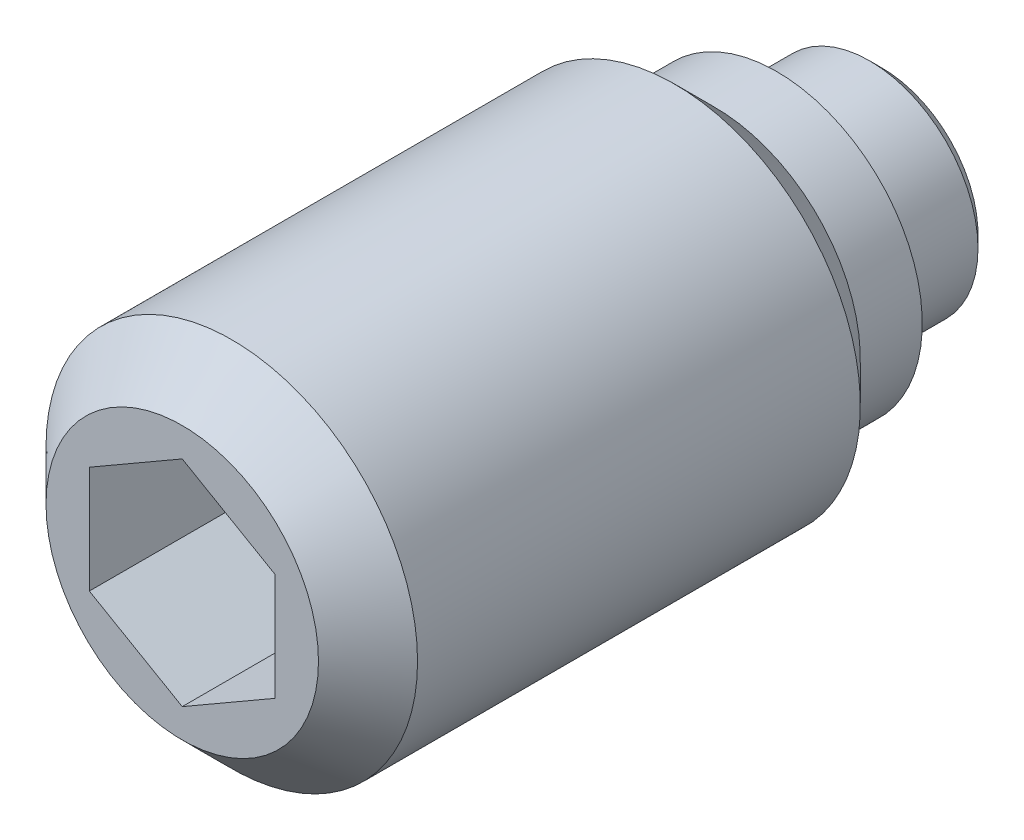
ISO-10303-21;
HEADER;
FILE_DESCRIPTION(('STEP AP214'),'2;1');
FILE_NAME('part.step','',(''),(''),'','','');
FILE_SCHEMA(('AUTOMOTIVE_DESIGN { 1 0 10303 214 1 1 1 1 }'));
ENDSEC;
DATA;
#1=APPLICATION_CONTEXT('core data for automotive mechanical design processes');
#2=APPLICATION_PROTOCOL_DEFINITION('international standard','automotive_design',2000,#1);
#3=PRODUCT_CONTEXT('',#1,'mechanical');
#4=PRODUCT('Part','Part','',(#3));
#5=PRODUCT_RELATED_PRODUCT_CATEGORY('part','',(#4));
#6=PRODUCT_DEFINITION_FORMATION('','',#4);
#7=PRODUCT_DEFINITION_CONTEXT('part definition',#1,'design');
#8=PRODUCT_DEFINITION('design','',#6,#7);
#9=PRODUCT_DEFINITION_SHAPE('','',#8);
#10=(LENGTH_UNIT() NAMED_UNIT(*) SI_UNIT(.MILLI.,.METRE.));
#11=(NAMED_UNIT(*) PLANE_ANGLE_UNIT() SI_UNIT($,.RADIAN.));
#12=(NAMED_UNIT(*) SI_UNIT($,.STERADIAN.) SOLID_ANGLE_UNIT());
#13=UNCERTAINTY_MEASURE_WITH_UNIT(LENGTH_MEASURE(1.E-05),#10,'distance_accuracy_value','');
#14=(GEOMETRIC_REPRESENTATION_CONTEXT(3) GLOBAL_UNCERTAINTY_ASSIGNED_CONTEXT((#13)) GLOBAL_UNIT_ASSIGNED_CONTEXT((#10,
#11,#12)) REPRESENTATION_CONTEXT('',''));
#15=CARTESIAN_POINT('',(0.,0.,0.));
#16=DIRECTION('',(0.,0.,1.));
#17=DIRECTION('',(1.,0.,0.));
#18=AXIS2_PLACEMENT_3D('',#15,#16,#17);
#19=CARTESIAN_POINT('',(0.,0.,0.));
#20=DIRECTION('',(0.,0.,-1.));
#21=DIRECTION('',(-1.,0.,0.));
#22=AXIS2_PLACEMENT_3D('',#19,#20,#21);
#23=CYLINDRICAL_SURFACE('',#22,1.75);
#24=CARTESIAN_POINT('',(0.,0.,0.2));
#25=DIRECTION('',(0.,0.,-1.));
#26=DIRECTION('',(-1.,0.,0.));
#27=AXIS2_PLACEMENT_3D('',#24,#25,#26);
#28=CIRCLE('',#27,1.75);
#29=CARTESIAN_POINT('',(-1.75,0.,0.2));
#30=VERTEX_POINT('',#29);
#31=EDGE_CURVE('E133',#30,#30,#28,.T.);
#32=ORIENTED_EDGE('',*,*,#31,.F.);
#33=EDGE_LOOP('',(#32));
#34=FACE_BOUND('',#33,.T.);
#35=CARTESIAN_POINT('',(0.,0.,1.7));
#36=DIRECTION('',(0.,0.,-1.));
#37=DIRECTION('',(-1.,0.,0.));
#38=AXIS2_PLACEMENT_3D('',#35,#36,#37);
#39=CIRCLE('',#38,1.75);
#40=CARTESIAN_POINT('',(-1.75,0.,1.7));
#41=VERTEX_POINT('',#40);
#42=EDGE_CURVE('E127',#41,#41,#39,.T.);
#43=ORIENTED_EDGE('',*,*,#42,.T.);
#44=EDGE_LOOP('',(#43));
#45=FACE_BOUND('',#44,.T.);
#46=ADVANCED_FACE('F14',(#34,#45),#23,.T.);
#47=CARTESIAN_POINT('',(0.,0.,0.2));
#48=DIRECTION('',(0.,0.,1.));
#49=DIRECTION('',(1.,0.,0.));
#50=AXIS2_PLACEMENT_3D('',#47,#48,#49);
#51=CONICAL_SURFACE('',#50,1.75,0.785398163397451);
#52=CARTESIAN_POINT('',(0.,0.,0.));
#53=DIRECTION('',(0.,0.,-1.));
#54=DIRECTION('',(-1.,0.,0.));
#55=AXIS2_PLACEMENT_3D('',#52,#53,#54);
#56=CIRCLE('',#55,1.55);
#57=CARTESIAN_POINT('',(-1.55,0.,0.));
#58=VERTEX_POINT('',#57);
#59=EDGE_CURVE('E130',#58,#58,#56,.T.);
#60=ORIENTED_EDGE('',*,*,#59,.F.);
#61=EDGE_LOOP('',(#60));
#62=FACE_BOUND('',#61,.T.);
#63=ORIENTED_EDGE('',*,*,#31,.T.);
#64=EDGE_LOOP('',(#63));
#65=FACE_BOUND('',#64,.T.);
#66=ADVANCED_FACE('F159',(#62,#65),#51,.T.);
#67=CARTESIAN_POINT('',(0.,1.55,0.));
#68=DIRECTION('',(0.,0.,1.));
#69=DIRECTION('',(1.,0.,0.));
#70=AXIS2_PLACEMENT_3D('',#67,#68,#69);
#71=PLANE('',#70);
#72=ORIENTED_EDGE('',*,*,#59,.T.);
#73=EDGE_LOOP('',(#72));
#74=FACE_BOUND('',#73,.T.);
#75=ADVANCED_FACE('F165',(#74),#71,.F.);
#76=CARTESIAN_POINT('',(0.,0.,1.7));
#77=DIRECTION('',(0.,0.,-1.));
#78=DIRECTION('',(-1.,0.,0.));
#79=AXIS2_PLACEMENT_3D('',#76,#77,#78);
#80=CYLINDRICAL_SURFACE('',#79,3.);
#81=CARTESIAN_POINT('',(0.,0.,3.35));
#82=DIRECTION('',(0.,0.,-1.));
#83=DIRECTION('',(-1.,0.,0.));
#84=AXIS2_PLACEMENT_3D('',#81,#82,#83);
#85=CIRCLE('',#84,3.);
#86=CARTESIAN_POINT('',(-3.,0.,3.35));
#87=VERTEX_POINT('',#86);
#88=EDGE_CURVE('E9',#87,#87,#85,.T.);
#89=ORIENTED_EDGE('',*,*,#88,.F.);
#90=EDGE_LOOP('',(#89));
#91=FACE_BOUND('',#90,.T.);
#92=CARTESIAN_POINT('',(0.,0.,10.5));
#93=DIRECTION('',(0.,0.,1.));
#94=DIRECTION('',(1.,0.,0.));
#95=AXIS2_PLACEMENT_3D('',#92,#93,#94);
#96=CIRCLE('',#95,3.);
#97=CARTESIAN_POINT('',(3.,0.,10.5));
#98=VERTEX_POINT('',#97);
#99=EDGE_CURVE('E124',#98,#98,#96,.T.);
#100=ORIENTED_EDGE('',*,*,#99,.F.);
#101=EDGE_LOOP('',(#100));
#102=FACE_BOUND('',#101,.T.);
#103=ADVANCED_FACE('F16',(#91,#102),#80,.T.);
#104=CARTESIAN_POINT('',(0.,2.35,1.7));
#105=DIRECTION('',(0.,0.,1.));
#106=DIRECTION('',(1.,0.,0.));
#107=AXIS2_PLACEMENT_3D('',#104,#105,#106);
#108=PLANE('',#107);
#109=CARTESIAN_POINT('',(0.,0.,1.7));
#110=DIRECTION('',(0.,0.,-1.));
#111=DIRECTION('',(-1.,0.,0.));
#112=AXIS2_PLACEMENT_3D('',#109,#110,#111);
#113=CIRCLE('',#112,2.35);
#114=CARTESIAN_POINT('',(-2.35,0.,1.7));
#115=VERTEX_POINT('',#114);
#116=EDGE_CURVE('E136',#115,#115,#113,.T.);
#117=ORIENTED_EDGE('',*,*,#116,.T.);
#118=EDGE_LOOP('',(#117));
#119=FACE_BOUND('',#118,.T.);
#120=ORIENTED_EDGE('',*,*,#42,.F.);
#121=EDGE_LOOP('',(#120));
#122=FACE_BOUND('',#121,.T.);
#123=ADVANCED_FACE('F156',(#119,#122),#108,.F.);
#124=CARTESIAN_POINT('',(0.,0.,1.7));
#125=DIRECTION('',(0.,0.,-1.));
#126=DIRECTION('',(-1.,0.,0.));
#127=AXIS2_PLACEMENT_3D('',#124,#125,#126);
#128=CYLINDRICAL_SURFACE('',#127,2.35);
#129=CARTESIAN_POINT('',(0.,0.,2.7));
#130=DIRECTION('',(0.,0.,-1.));
#131=DIRECTION('',(-1.,0.,0.));
#132=AXIS2_PLACEMENT_3D('',#129,#130,#131);
#133=CIRCLE('',#132,2.35);
#134=CARTESIAN_POINT('',(-2.35,0.,2.7));
#135=VERTEX_POINT('',#134);
#136=EDGE_CURVE('E22',#135,#135,#133,.T.);
#137=ORIENTED_EDGE('',*,*,#136,.T.);
#138=EDGE_LOOP('',(#137));
#139=FACE_BOUND('',#138,.T.);
#140=ORIENTED_EDGE('',*,*,#116,.F.);
#141=EDGE_LOOP('',(#140));
#142=FACE_BOUND('',#141,.T.);
#143=ADVANCED_FACE('F141',(#139,#142),#128,.T.);
#144=CARTESIAN_POINT('',(0.,0.,3.35));
#145=DIRECTION('',(0.,0.,1.));
#146=DIRECTION('',(1.,0.,0.));
#147=AXIS2_PLACEMENT_3D('',#144,#145,#146);
#148=CONICAL_SURFACE('',#147,3.,0.785398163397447);
#149=ORIENTED_EDGE('',*,*,#88,.T.);
#150=EDGE_LOOP('',(#149));
#151=FACE_BOUND('',#150,.T.);
#152=ORIENTED_EDGE('',*,*,#136,.F.);
#153=EDGE_LOOP('',(#152));
#154=FACE_BOUND('',#153,.T.);
#155=ADVANCED_FACE('F144',(#151,#154),#148,.T.);
#156=CARTESIAN_POINT('',(0.,-2.2,11.3));
#157=DIRECTION('',(0.,0.,1.));
#158=DIRECTION('',(1.,0.,0.));
#159=AXIS2_PLACEMENT_3D('',#156,#157,#158);
#160=PLANE('',#159);
#161=DIRECTION('',(0.866025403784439,-0.5,0.));
#162=VECTOR('',#161,1.);
#163=CARTESIAN_POINT('',(-1.5,-0.866025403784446,11.3));
#164=LINE('',#163,#162);
#165=CARTESIAN_POINT('',(-1.5,-0.866025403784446,11.3));
#166=VERTEX_POINT('',#165);
#167=CARTESIAN_POINT('',(0.,-1.73205080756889,11.3));
#168=VERTEX_POINT('',#167);
#169=EDGE_CURVE('E29',#166,#168,#164,.T.);
#170=ORIENTED_EDGE('',*,*,#169,.F.);
#171=DIRECTION('',(0.,-1.,0.));
#172=VECTOR('',#171,1.);
#173=CARTESIAN_POINT('',(-1.5,0.866025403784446,11.3));
#174=LINE('',#173,#172);
#175=CARTESIAN_POINT('',(-1.5,0.866025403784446,11.3));
#176=VERTEX_POINT('',#175);
#177=EDGE_CURVE('E112',#176,#166,#174,.T.);
#178=ORIENTED_EDGE('',*,*,#177,.F.);
#179=DIRECTION('',(-0.866025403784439,-0.5,0.));
#180=VECTOR('',#179,1.);
#181=CARTESIAN_POINT('',(0.,1.73205080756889,11.3));
#182=LINE('',#181,#180);
#183=CARTESIAN_POINT('',(0.,1.73205080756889,11.3));
#184=VERTEX_POINT('',#183);
#185=EDGE_CURVE('E110',#184,#176,#182,.T.);
#186=ORIENTED_EDGE('',*,*,#185,.F.);
#187=DIRECTION('',(-0.866025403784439,0.5,0.));
#188=VECTOR('',#187,1.);
#189=CARTESIAN_POINT('',(1.5,0.866025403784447,11.3));
#190=LINE('',#189,#188);
#191=CARTESIAN_POINT('',(1.5,0.866025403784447,11.3));
#192=VERTEX_POINT('',#191);
#193=EDGE_CURVE('E77',#192,#184,#190,.T.);
#194=ORIENTED_EDGE('',*,*,#193,.F.);
#195=DIRECTION('',(0.,1.,0.));
#196=VECTOR('',#195,1.);
#197=CARTESIAN_POINT('',(1.5,-0.866025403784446,11.3));
#198=LINE('',#197,#196);
#199=CARTESIAN_POINT('',(1.5,-0.866025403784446,11.3));
#200=VERTEX_POINT('',#199);
#201=EDGE_CURVE('E106',#200,#192,#198,.T.);
#202=ORIENTED_EDGE('',*,*,#201,.F.);
#203=DIRECTION('',(0.866025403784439,0.5,0.));
#204=VECTOR('',#203,1.);
#205=CARTESIAN_POINT('',(0.,-1.73205080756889,11.3));
#206=LINE('',#205,#204);
#207=EDGE_CURVE('E103',#168,#200,#206,.T.);
#208=ORIENTED_EDGE('',*,*,#207,.F.);
#209=EDGE_LOOP('',(#170,#178,#186,#194,#202,#208));
#210=FACE_BOUND('',#209,.T.);
#211=CARTESIAN_POINT('',(0.,0.,11.3));
#212=DIRECTION('',(0.,0.,1.));
#213=DIRECTION('',(1.,0.,0.));
#214=AXIS2_PLACEMENT_3D('',#211,#212,#213);
#215=CIRCLE('',#214,2.2);
#216=CARTESIAN_POINT('',(2.2,0.,11.3));
#217=VERTEX_POINT('',#216);
#218=EDGE_CURVE('E116',#217,#217,#215,.T.);
#219=ORIENTED_EDGE('',*,*,#218,.T.);
#220=EDGE_LOOP('',(#219));
#221=FACE_BOUND('',#220,.T.);
#222=ADVANCED_FACE('F146',(#210,#221),#160,.T.);
#223=CARTESIAN_POINT('',(0.,0.,11.3));
#224=DIRECTION('',(0.,0.,-1.));
#225=DIRECTION('',(-1.,0.,0.));
#226=AXIS2_PLACEMENT_3D('',#223,#224,#225);
#227=CONICAL_SURFACE('',#226,2.2,0.785398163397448);
#228=ORIENTED_EDGE('',*,*,#99,.T.);
#229=EDGE_LOOP('',(#228));
#230=FACE_BOUND('',#229,.T.);
#231=ORIENTED_EDGE('',*,*,#218,.F.);
#232=EDGE_LOOP('',(#231));
#233=FACE_BOUND('',#232,.T.);
#234=ADVANCED_FACE('F153',(#230,#233),#227,.T.);
#235=CARTESIAN_POINT('',(-1.5,-0.866025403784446,7.8));
#236=DIRECTION('',(-0.5,-0.866025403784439,0.));
#237=DIRECTION('',(0.866025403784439,-0.5,0.));
#238=AXIS2_PLACEMENT_3D('',#235,#236,#237);
#239=PLANE('',#238);
#240=ORIENTED_EDGE('',*,*,#169,.T.);
#241=DIRECTION('',(0.,0.,1.));
#242=VECTOR('',#241,1.);
#243=CARTESIAN_POINT('',(0.,-1.73205080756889,7.8));
#244=LINE('',#243,#242);
#245=CARTESIAN_POINT('',(0.,-1.73205080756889,7.8));
#246=VERTEX_POINT('',#245);
#247=EDGE_CURVE('E59',#246,#168,#244,.T.);
#248=ORIENTED_EDGE('',*,*,#247,.F.);
#249=DIRECTION('',(0.866025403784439,-0.5,0.));
#250=VECTOR('',#249,1.);
#251=CARTESIAN_POINT('',(-1.5,-0.866025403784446,7.8));
#252=LINE('',#251,#250);
#253=CARTESIAN_POINT('',(-1.5,-0.866025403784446,7.8));
#254=VERTEX_POINT('',#253);
#255=EDGE_CURVE('E114',#254,#246,#252,.T.);
#256=ORIENTED_EDGE('',*,*,#255,.F.);
#257=DIRECTION('',(0.,0.,1.));
#258=VECTOR('',#257,1.);
#259=CARTESIAN_POINT('',(-1.5,-0.866025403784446,7.8));
#260=LINE('',#259,#258);
#261=EDGE_CURVE('E37',#254,#166,#260,.T.);
#262=ORIENTED_EDGE('',*,*,#261,.T.);
#263=EDGE_LOOP('',(#240,#248,#256,#262));
#264=FACE_BOUND('',#263,.T.);
#265=ADVANCED_FACE('F191',(#264),#239,.F.);
#266=CARTESIAN_POINT('',(-1.5,0.866025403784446,7.8));
#267=DIRECTION('',(-1.,0.,0.));
#268=DIRECTION('',(0.,0.,1.));
#269=AXIS2_PLACEMENT_3D('',#266,#267,#268);
#270=PLANE('',#269);
#271=ORIENTED_EDGE('',*,*,#177,.T.);
#272=ORIENTED_EDGE('',*,*,#261,.F.);
#273=DIRECTION('',(0.,-1.,0.));
#274=VECTOR('',#273,1.);
#275=CARTESIAN_POINT('',(-1.5,0.866025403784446,7.8));
#276=LINE('',#275,#274);
#277=CARTESIAN_POINT('',(-1.5,0.866025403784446,7.8));
#278=VERTEX_POINT('',#277);
#279=EDGE_CURVE('E89',#278,#254,#276,.T.);
#280=ORIENTED_EDGE('',*,*,#279,.F.);
#281=DIRECTION('',(0.,0.,1.));
#282=VECTOR('',#281,1.);
#283=CARTESIAN_POINT('',(-1.5,0.866025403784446,7.8));
#284=LINE('',#283,#282);
#285=EDGE_CURVE('E81',#278,#176,#284,.T.);
#286=ORIENTED_EDGE('',*,*,#285,.T.);
#287=EDGE_LOOP('',(#271,#272,#280,#286));
#288=FACE_BOUND('',#287,.T.);
#289=ADVANCED_FACE('F198',(#288),#270,.F.);
#290=CARTESIAN_POINT('',(0.,1.73205080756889,7.8));
#291=DIRECTION('',(-0.5,0.866025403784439,0.));
#292=DIRECTION('',(-0.866025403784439,-0.5,0.));
#293=AXIS2_PLACEMENT_3D('',#290,#291,#292);
#294=PLANE('',#293);
#295=ORIENTED_EDGE('',*,*,#185,.T.);
#296=ORIENTED_EDGE('',*,*,#285,.F.);
#297=DIRECTION('',(-0.866025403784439,-0.5,0.));
#298=VECTOR('',#297,1.);
#299=CARTESIAN_POINT('',(0.,1.73205080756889,7.8));
#300=LINE('',#299,#298);
#301=CARTESIAN_POINT('',(0.,1.73205080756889,7.8));
#302=VERTEX_POINT('',#301);
#303=EDGE_CURVE('E85',#302,#278,#300,.T.);
#304=ORIENTED_EDGE('',*,*,#303,.F.);
#305=DIRECTION('',(0.,0.,1.));
#306=VECTOR('',#305,1.);
#307=CARTESIAN_POINT('',(0.,1.73205080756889,7.8));
#308=LINE('',#307,#306);
#309=EDGE_CURVE('E70',#302,#184,#308,.T.);
#310=ORIENTED_EDGE('',*,*,#309,.T.);
#311=EDGE_LOOP('',(#295,#296,#304,#310));
#312=FACE_BOUND('',#311,.T.);
#313=ADVANCED_FACE('F86',(#312),#294,.F.);
#314=CARTESIAN_POINT('',(1.5,0.866025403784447,7.8));
#315=DIRECTION('',(0.5,0.866025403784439,0.));
#316=DIRECTION('',(-0.866025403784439,0.5,0.));
#317=AXIS2_PLACEMENT_3D('',#314,#315,#316);
#318=PLANE('',#317);
#319=ORIENTED_EDGE('',*,*,#193,.T.);
#320=ORIENTED_EDGE('',*,*,#309,.F.);
#321=DIRECTION('',(-0.866025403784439,0.5,0.));
#322=VECTOR('',#321,1.);
#323=CARTESIAN_POINT('',(1.5,0.866025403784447,7.8));
#324=LINE('',#323,#322);
#325=CARTESIAN_POINT('',(1.5,0.866025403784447,7.8));
#326=VERTEX_POINT('',#325);
#327=EDGE_CURVE('E74',#326,#302,#324,.T.);
#328=ORIENTED_EDGE('',*,*,#327,.F.);
#329=DIRECTION('',(0.,0.,1.));
#330=VECTOR('',#329,1.);
#331=CARTESIAN_POINT('',(1.5,0.866025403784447,7.8));
#332=LINE('',#331,#330);
#333=EDGE_CURVE('E82',#326,#192,#332,.T.);
#334=ORIENTED_EDGE('',*,*,#333,.T.);
#335=EDGE_LOOP('',(#319,#320,#328,#334));
#336=FACE_BOUND('',#335,.T.);
#337=ADVANCED_FACE('F72',(#336),#318,.F.);
#338=CARTESIAN_POINT('',(1.5,-0.866025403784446,7.8));
#339=DIRECTION('',(1.,0.,0.));
#340=DIRECTION('',(0.,1.,0.));
#341=AXIS2_PLACEMENT_3D('',#338,#339,#340);
#342=PLANE('',#341);
#343=ORIENTED_EDGE('',*,*,#201,.T.);
#344=ORIENTED_EDGE('',*,*,#333,.F.);
#345=DIRECTION('',(0.,1.,0.));
#346=VECTOR('',#345,1.);
#347=CARTESIAN_POINT('',(1.5,-0.866025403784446,7.8));
#348=LINE('',#347,#346);
#349=CARTESIAN_POINT('',(1.5,-0.866025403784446,7.8));
#350=VERTEX_POINT('',#349);
#351=EDGE_CURVE('E95',#350,#326,#348,.T.);
#352=ORIENTED_EDGE('',*,*,#351,.F.);
#353=DIRECTION('',(0.,0.,1.));
#354=VECTOR('',#353,1.);
#355=CARTESIAN_POINT('',(1.5,-0.866025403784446,7.8));
#356=LINE('',#355,#354);
#357=EDGE_CURVE('E119',#350,#200,#356,.T.);
#358=ORIENTED_EDGE('',*,*,#357,.T.);
#359=EDGE_LOOP('',(#343,#344,#352,#358));
#360=FACE_BOUND('',#359,.T.);
#361=ADVANCED_FACE('F204',(#360),#342,.F.);
#362=CARTESIAN_POINT('',(0.,-1.73205080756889,7.8));
#363=DIRECTION('',(0.5,-0.866025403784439,0.));
#364=DIRECTION('',(0.866025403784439,0.5,0.));
#365=AXIS2_PLACEMENT_3D('',#362,#363,#364);
#366=PLANE('',#365);
#367=ORIENTED_EDGE('',*,*,#207,.T.);
#368=ORIENTED_EDGE('',*,*,#357,.F.);
#369=DIRECTION('',(0.866025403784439,0.5,0.));
#370=VECTOR('',#369,1.);
#371=CARTESIAN_POINT('',(0.,-1.73205080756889,7.8));
#372=LINE('',#371,#370);
#373=EDGE_CURVE('E97',#246,#350,#372,.T.);
#374=ORIENTED_EDGE('',*,*,#373,.F.);
#375=ORIENTED_EDGE('',*,*,#247,.T.);
#376=EDGE_LOOP('',(#367,#368,#374,#375));
#377=FACE_BOUND('',#376,.T.);
#378=ADVANCED_FACE('F201',(#377),#366,.F.);
#379=CARTESIAN_POINT('',(0.,0.,7.8));
#380=DIRECTION('',(0.,0.,1.));
#381=DIRECTION('',(1.,0.,0.));
#382=AXIS2_PLACEMENT_3D('',#379,#380,#381);
#383=PLANE('',#382);
#384=ORIENTED_EDGE('',*,*,#255,.T.);
#385=ORIENTED_EDGE('',*,*,#373,.T.);
#386=ORIENTED_EDGE('',*,*,#351,.T.);
#387=ORIENTED_EDGE('',*,*,#327,.T.);
#388=ORIENTED_EDGE('',*,*,#303,.T.);
#389=ORIENTED_EDGE('',*,*,#279,.T.);
#390=EDGE_LOOP('',(#384,#385,#386,#387,#388,#389));
#391=FACE_BOUND('',#390,.T.);
#392=ADVANCED_FACE('F92',(#391),#383,.T.);
#393=CLOSED_SHELL('',(#46,#66,#75,#103,#123,#143,#155,#222,#234,#265,#289,#313,#337,#361,#378,#392));
#394=MANIFOLD_SOLID_BREP('B1',#393);
#395=ADVANCED_BREP_SHAPE_REPRESENTATION('',(#18,#394),#14);
#396=SHAPE_DEFINITION_REPRESENTATION(#9,#395);
ENDSEC;
END-ISO-10303-21;
